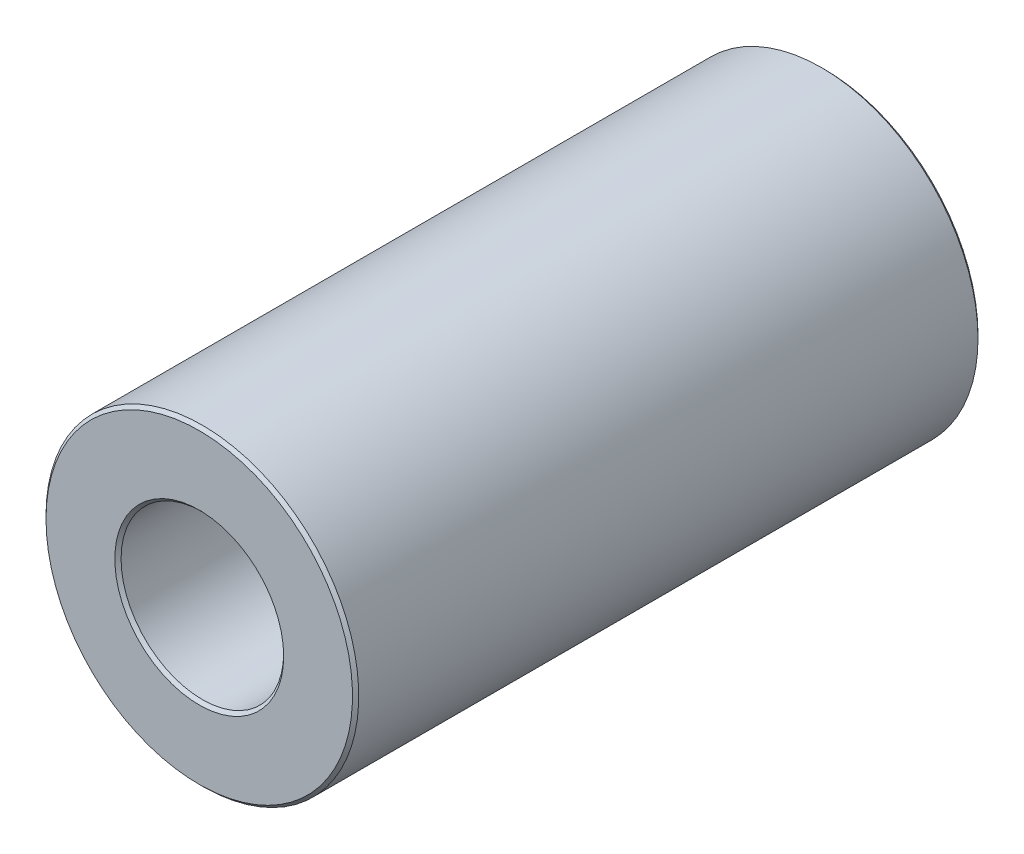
from build123d import *

# Parameters (mm, degrees)
SKETCH1_R           = 5
SKETCH1_R_2         = 2.6
BOSS_EXTRUDE2_DEPTH = 10
CHAMFER3_SIZE       = 0.1


with BuildPart() as part:
    # Sketch1 → Boss-Extrude2 (new, symmetric)
    with BuildSketch(Plane.XY):
        Circle(SKETCH1_R)
        Circle(SKETCH1_R_2, mode=Mode.SUBTRACT)
    extrude(amount=BOSS_EXTRUDE2_DEPTH, both=True)

    # Chamfer3
    chamfer3_edges = [part.edges().sort_by_distance(p)[0] for p in [
        (-5, 0, -10),
        (-5, 0, 10),
        (-2.6, 0, -10),
        (-2.6, 0, 10),
    ]]
    chamfer(chamfer3_edges, length=CHAMFER3_SIZE)


solid = part.part
